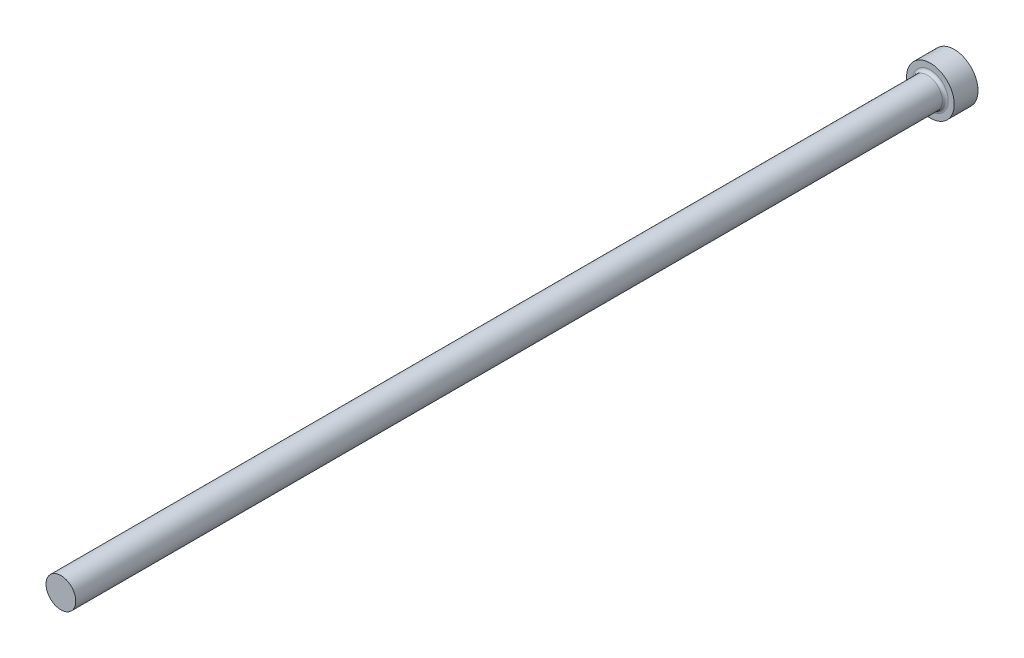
from build123d import *

# Parameters (mm, degrees)
FILLET1_R = 0.5


with BuildPart() as part:
    # FV → Revolve1 (revolve)
    with BuildSketch(Plane(origin=(0, 0, 0), x_dir=(1, 0, 0), z_dir=(0, 1, 0)), mode=Mode.PRIVATE) as revolve1_sk:
        Polygon((0, 0), (4, 0), (4, -4), (2.5, -4), (2.5, -150), (0, -150), align=None)
    revolve(revolve1_sk.sketch.rotate(Axis((0, 0, -9.033228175), (0, 0, 1)), 180), axis=Axis((0, 0, -9.033228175), (0, 0, 1)))

    # Fillet1
    fillet1_edges = [part.edges().sort_by_distance(p)[0] for p in [
        (2.5, 0, 4),
    ]]
    fillet(fillet1_edges, radius=FILLET1_R)


solid = part.part
